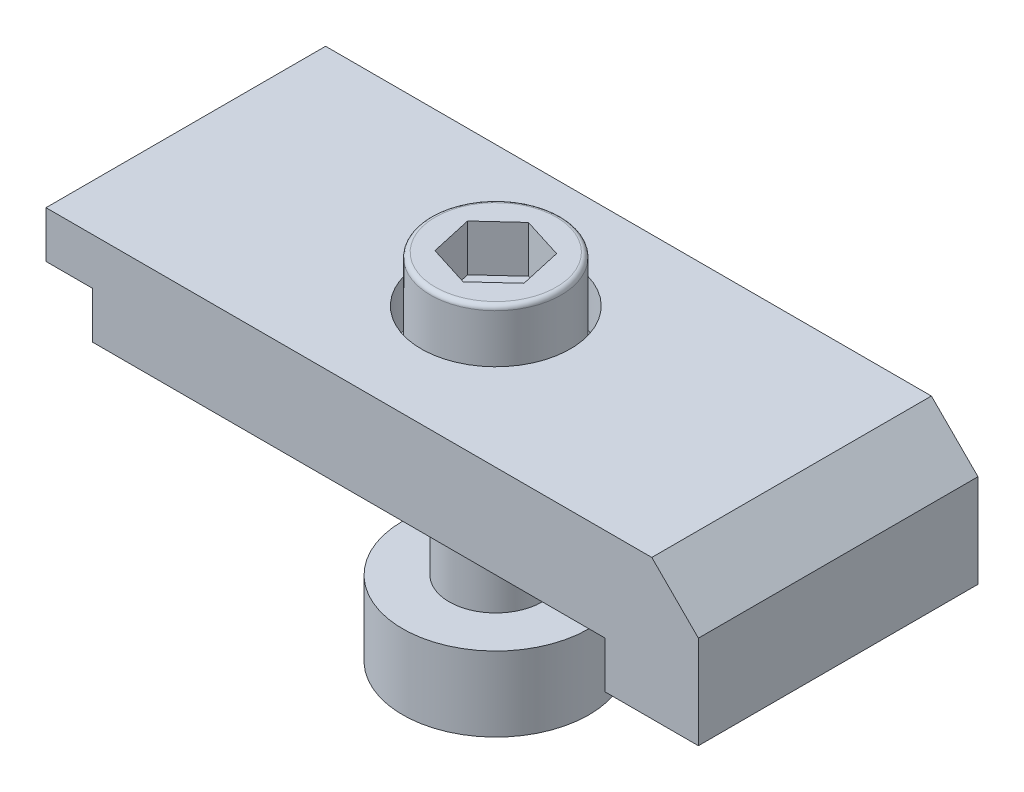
ISO-10303-21;
HEADER;
FILE_DESCRIPTION(('STEP AP214'),'2;1');
FILE_NAME('part.step','',(''),(''),'','','');
FILE_SCHEMA(('AUTOMOTIVE_DESIGN { 1 0 10303 214 1 1 1 1 }'));
ENDSEC;
DATA;
#1=APPLICATION_CONTEXT('core data for automotive mechanical design processes');
#2=APPLICATION_PROTOCOL_DEFINITION('international standard','automotive_design',2000,#1);
#3=PRODUCT_CONTEXT('',#1,'mechanical');
#4=PRODUCT('Part','Part','',(#3));
#5=PRODUCT_RELATED_PRODUCT_CATEGORY('part','',(#4));
#6=PRODUCT_DEFINITION_FORMATION('','',#4);
#7=PRODUCT_DEFINITION_CONTEXT('part definition',#1,'design');
#8=PRODUCT_DEFINITION('design','',#6,#7);
#9=PRODUCT_DEFINITION_SHAPE('','',#8);
#10=(LENGTH_UNIT() NAMED_UNIT(*) SI_UNIT(.MILLI.,.METRE.));
#11=(NAMED_UNIT(*) PLANE_ANGLE_UNIT() SI_UNIT($,.RADIAN.));
#12=(NAMED_UNIT(*) SI_UNIT($,.STERADIAN.) SOLID_ANGLE_UNIT());
#13=UNCERTAINTY_MEASURE_WITH_UNIT(LENGTH_MEASURE(1.E-05),#10,'distance_accuracy_value','');
#14=(GEOMETRIC_REPRESENTATION_CONTEXT(3) GLOBAL_UNCERTAINTY_ASSIGNED_CONTEXT((#13)) GLOBAL_UNIT_ASSIGNED_CONTEXT((#10,
#11,#12)) REPRESENTATION_CONTEXT('',''));
#15=CARTESIAN_POINT('',(0.,0.,0.));
#16=DIRECTION('',(0.,0.,1.));
#17=DIRECTION('',(1.,0.,0.));
#18=AXIS2_PLACEMENT_3D('',#15,#16,#17);
#19=CARTESIAN_POINT('',(-36.7394672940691,-18.,0.));
#20=DIRECTION('',(0.,1.,0.));
#21=DIRECTION('',(-1.,0.,0.));
#22=AXIS2_PLACEMENT_3D('',#19,#20,#21);
#23=CYLINDRICAL_SURFACE('',#22,5.);
#24=CARTESIAN_POINT('',(-36.7394672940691,4.99999999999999,0.));
#25=DIRECTION('',(0.,1.,0.));
#26=DIRECTION('',(-1.,0.,0.));
#27=AXIS2_PLACEMENT_3D('',#24,#25,#26);
#28=CIRCLE('',#27,5.);
#29=CARTESIAN_POINT('',(-41.7394672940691,4.99999999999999,0.));
#30=VERTEX_POINT('',#29);
#31=EDGE_CURVE('E235',#30,#30,#28,.T.);
#32=ORIENTED_EDGE('',*,*,#31,.F.);
#33=EDGE_LOOP('',(#32));
#34=FACE_BOUND('',#33,.T.);
#35=CARTESIAN_POINT('',(-36.7394672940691,-10.,0.));
#36=DIRECTION('',(0.,-1.,0.));
#37=DIRECTION('',(1.,0.,0.));
#38=AXIS2_PLACEMENT_3D('',#35,#36,#37);
#39=CIRCLE('',#38,5.);
#40=CARTESIAN_POINT('',(-31.7394672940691,-10.,0.));
#41=VERTEX_POINT('',#40);
#42=EDGE_CURVE('E31',#41,#41,#39,.F.);
#43=ORIENTED_EDGE('',*,*,#42,.T.);
#44=EDGE_LOOP('',(#43));
#45=FACE_BOUND('',#44,.T.);
#46=ADVANCED_FACE('F27',(#34,#45),#23,.T.);
#47=CARTESIAN_POINT('',(-36.7394672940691,9.99999999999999,0.));
#48=DIRECTION('',(0.,1.,0.));
#49=DIRECTION('',(-1.,0.,0.));
#50=AXIS2_PLACEMENT_3D('',#47,#48,#49);
#51=PLANE('',#50);
#52=CARTESIAN_POINT('',(-36.7394672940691,9.99999999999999,0.));
#53=DIRECTION('',(0.,1.,0.));
#54=DIRECTION('',(-1.,0.,0.));
#55=AXIS2_PLACEMENT_3D('',#52,#53,#54);
#56=CIRCLE('',#55,8.);
#57=CARTESIAN_POINT('',(-44.7394672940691,9.99999999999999,0.));
#58=VERTEX_POINT('',#57);
#59=EDGE_CURVE('E164',#58,#58,#56,.T.);
#60=ORIENTED_EDGE('',*,*,#59,.T.);
#61=EDGE_LOOP('',(#60));
#62=FACE_BOUND('',#61,.T.);
#63=CARTESIAN_POINT('',(-36.7394672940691,9.99999999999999,0.));
#64=DIRECTION('',(0.,1.,0.));
#65=DIRECTION('',(-1.,0.,0.));
#66=AXIS2_PLACEMENT_3D('',#63,#64,#65);
#67=CIRCLE('',#66,7.);
#68=CARTESIAN_POINT('',(-43.7394672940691,9.99999999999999,0.));
#69=VERTEX_POINT('',#68);
#70=EDGE_CURVE('E157',#69,#69,#67,.T.);
#71=ORIENTED_EDGE('',*,*,#70,.F.);
#72=EDGE_LOOP('',(#71));
#73=FACE_BOUND('',#72,.T.);
#74=ADVANCED_FACE('F303',(#62,#73),#51,.T.);
#75=CARTESIAN_POINT('',(0.,15.,15.));
#76=DIRECTION('',(-1.,0.,0.));
#77=DIRECTION('',(0.,0.,1.));
#78=AXIS2_PLACEMENT_3D('',#75,#76,#77);
#79=PLANE('',#78);
#80=DIRECTION('',(0.,1.,0.));
#81=VECTOR('',#80,1.);
#82=CARTESIAN_POINT('',(0.,15.,-15.));
#83=LINE('',#82,#81);
#84=CARTESIAN_POINT('',(0.,0.,-15.));
#85=VERTEX_POINT('',#84);
#86=CARTESIAN_POINT('',(0.,9.99999999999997,-15.));
#87=VERTEX_POINT('',#86);
#88=EDGE_CURVE('E167',#85,#87,#83,.T.);
#89=ORIENTED_EDGE('',*,*,#88,.T.);
#90=DIRECTION('',(0.,0.,1.));
#91=VECTOR('',#90,1.);
#92=CARTESIAN_POINT('',(0.,9.99999999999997,15.));
#93=LINE('',#92,#91);
#94=CARTESIAN_POINT('',(0.,9.99999999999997,15.));
#95=VERTEX_POINT('',#94);
#96=EDGE_CURVE('E227',#87,#95,#93,.T.);
#97=ORIENTED_EDGE('',*,*,#96,.T.);
#98=DIRECTION('',(0.,1.,0.));
#99=VECTOR('',#98,1.);
#100=CARTESIAN_POINT('',(0.,15.,15.));
#101=LINE('',#100,#99);
#102=CARTESIAN_POINT('',(0.,0.,15.));
#103=VERTEX_POINT('',#102);
#104=EDGE_CURVE('E184',#103,#95,#101,.T.);
#105=ORIENTED_EDGE('',*,*,#104,.F.);
#106=DIRECTION('',(0.,0.,-1.));
#107=VECTOR('',#106,1.);
#108=CARTESIAN_POINT('',(0.,0.,15.));
#109=LINE('',#108,#107);
#110=EDGE_CURVE('E201',#103,#85,#109,.T.);
#111=ORIENTED_EDGE('',*,*,#110,.T.);
#112=EDGE_LOOP('',(#89,#97,#105,#111));
#113=FACE_BOUND('',#112,.T.);
#114=ADVANCED_FACE('F29',(#113),#79,.F.);
#115=CARTESIAN_POINT('',(-70.,15.,15.));
#116=DIRECTION('',(0.,-1.,0.));
#117=DIRECTION('',(1.,0.,0.));
#118=AXIS2_PLACEMENT_3D('',#115,#116,#117);
#119=PLANE('',#118);
#120=CARTESIAN_POINT('',(-36.7394672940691,15.,0.));
#121=DIRECTION('',(0.,1.,0.));
#122=DIRECTION('',(-1.,0.,0.));
#123=AXIS2_PLACEMENT_3D('',#120,#121,#122);
#124=CIRCLE('',#123,8.);
#125=CARTESIAN_POINT('',(-44.7394672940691,15.,0.));
#126=VERTEX_POINT('',#125);
#127=EDGE_CURVE('E160',#126,#126,#124,.T.);
#128=ORIENTED_EDGE('',*,*,#127,.F.);
#129=EDGE_LOOP('',(#128));
#130=FACE_BOUND('',#129,.T.);
#131=DIRECTION('',(-1.,0.,0.));
#132=VECTOR('',#131,1.);
#133=CARTESIAN_POINT('',(-70.,15.,15.));
#134=LINE('',#133,#132);
#135=CARTESIAN_POINT('',(-5.00000000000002,15.,15.));
#136=VERTEX_POINT('',#135);
#137=CARTESIAN_POINT('',(-70.,15.,15.));
#138=VERTEX_POINT('',#137);
#139=EDGE_CURVE('E187',#136,#138,#134,.T.);
#140=ORIENTED_EDGE('',*,*,#139,.F.);
#141=DIRECTION('',(0.,0.,-1.));
#142=VECTOR('',#141,1.);
#143=CARTESIAN_POINT('',(-5.,15.,15.));
#144=LINE('',#143,#142);
#145=CARTESIAN_POINT('',(-5.00000000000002,15.,-15.));
#146=VERTEX_POINT('',#145);
#147=EDGE_CURVE('E222',#136,#146,#144,.T.);
#148=ORIENTED_EDGE('',*,*,#147,.T.);
#149=DIRECTION('',(-1.,0.,0.));
#150=VECTOR('',#149,1.);
#151=CARTESIAN_POINT('',(-70.,15.,-15.));
#152=LINE('',#151,#150);
#153=CARTESIAN_POINT('',(-70.,15.,-15.));
#154=VERTEX_POINT('',#153);
#155=EDGE_CURVE('E170',#146,#154,#152,.T.);
#156=ORIENTED_EDGE('',*,*,#155,.T.);
#157=DIRECTION('',(0.,0.,-1.));
#158=VECTOR('',#157,1.);
#159=CARTESIAN_POINT('',(-70.,15.,15.));
#160=LINE('',#159,#158);
#161=EDGE_CURVE('E219',#138,#154,#160,.T.);
#162=ORIENTED_EDGE('',*,*,#161,.F.);
#163=EDGE_LOOP('',(#140,#148,#156,#162));
#164=FACE_BOUND('',#163,.T.);
#165=ADVANCED_FACE('F374',(#130,#164),#119,.F.);
#166=CARTESIAN_POINT('',(-70.,10.,15.));
#167=DIRECTION('',(1.,0.,0.));
#168=DIRECTION('',(0.,0.,-1.));
#169=AXIS2_PLACEMENT_3D('',#166,#167,#168);
#170=PLANE('',#169);
#171=DIRECTION('',(0.,-1.,0.));
#172=VECTOR('',#171,1.);
#173=CARTESIAN_POINT('',(-70.,10.,-15.));
#174=LINE('',#173,#172);
#175=CARTESIAN_POINT('',(-70.,10.,-15.));
#176=VERTEX_POINT('',#175);
#177=EDGE_CURVE('E172',#154,#176,#174,.T.);
#178=ORIENTED_EDGE('',*,*,#177,.T.);
#179=DIRECTION('',(0.,0.,-1.));
#180=VECTOR('',#179,1.);
#181=CARTESIAN_POINT('',(-70.,10.,15.));
#182=LINE('',#181,#180);
#183=CARTESIAN_POINT('',(-70.,10.,15.));
#184=VERTEX_POINT('',#183);
#185=EDGE_CURVE('E216',#184,#176,#182,.T.);
#186=ORIENTED_EDGE('',*,*,#185,.F.);
#187=DIRECTION('',(0.,-1.,0.));
#188=VECTOR('',#187,1.);
#189=CARTESIAN_POINT('',(-70.,10.,15.));
#190=LINE('',#189,#188);
#191=EDGE_CURVE('E189',#138,#184,#190,.T.);
#192=ORIENTED_EDGE('',*,*,#191,.F.);
#193=ORIENTED_EDGE('',*,*,#161,.T.);
#194=EDGE_LOOP('',(#178,#186,#192,#193));
#195=FACE_BOUND('',#194,.T.);
#196=ADVANCED_FACE('F371',(#195),#170,.F.);
#197=CARTESIAN_POINT('',(-65.,10.,15.));
#198=DIRECTION('',(0.,1.,0.));
#199=DIRECTION('',(-1.,0.,0.));
#200=AXIS2_PLACEMENT_3D('',#197,#198,#199);
#201=PLANE('',#200);
#202=DIRECTION('',(1.,0.,0.));
#203=VECTOR('',#202,1.);
#204=CARTESIAN_POINT('',(-65.,10.,-15.));
#205=LINE('',#204,#203);
#206=CARTESIAN_POINT('',(-65.,10.,-15.));
#207=VERTEX_POINT('',#206);
#208=EDGE_CURVE('E174',#176,#207,#205,.T.);
#209=ORIENTED_EDGE('',*,*,#208,.T.);
#210=DIRECTION('',(0.,0.,-1.));
#211=VECTOR('',#210,1.);
#212=CARTESIAN_POINT('',(-65.,10.,15.));
#213=LINE('',#212,#211);
#214=CARTESIAN_POINT('',(-65.,10.,15.));
#215=VERTEX_POINT('',#214);
#216=EDGE_CURVE('E213',#215,#207,#213,.T.);
#217=ORIENTED_EDGE('',*,*,#216,.F.);
#218=DIRECTION('',(1.,0.,0.));
#219=VECTOR('',#218,1.);
#220=CARTESIAN_POINT('',(-65.,10.,15.));
#221=LINE('',#220,#219);
#222=EDGE_CURVE('E191',#184,#215,#221,.T.);
#223=ORIENTED_EDGE('',*,*,#222,.F.);
#224=ORIENTED_EDGE('',*,*,#185,.T.);
#225=EDGE_LOOP('',(#209,#217,#223,#224));
#226=FACE_BOUND('',#225,.T.);
#227=ADVANCED_FACE('F367',(#226),#201,.F.);
#228=CARTESIAN_POINT('',(-65.,4.99999999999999,15.));
#229=DIRECTION('',(1.,0.,0.));
#230=DIRECTION('',(0.,0.,-1.));
#231=AXIS2_PLACEMENT_3D('',#228,#229,#230);
#232=PLANE('',#231);
#233=DIRECTION('',(0.,-1.,0.));
#234=VECTOR('',#233,1.);
#235=CARTESIAN_POINT('',(-65.,4.99999999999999,-15.));
#236=LINE('',#235,#234);
#237=CARTESIAN_POINT('',(-65.,4.99999999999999,-15.));
#238=VERTEX_POINT('',#237);
#239=EDGE_CURVE('E176',#207,#238,#236,.T.);
#240=ORIENTED_EDGE('',*,*,#239,.T.);
#241=DIRECTION('',(0.,0.,-1.));
#242=VECTOR('',#241,1.);
#243=CARTESIAN_POINT('',(-65.,4.99999999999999,15.));
#244=LINE('',#243,#242);
#245=CARTESIAN_POINT('',(-65.,4.99999999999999,15.));
#246=VERTEX_POINT('',#245);
#247=EDGE_CURVE('E210',#246,#238,#244,.T.);
#248=ORIENTED_EDGE('',*,*,#247,.F.);
#249=DIRECTION('',(0.,-1.,0.));
#250=VECTOR('',#249,1.);
#251=CARTESIAN_POINT('',(-65.,4.99999999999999,15.));
#252=LINE('',#251,#250);
#253=EDGE_CURVE('E193',#215,#246,#252,.T.);
#254=ORIENTED_EDGE('',*,*,#253,.F.);
#255=ORIENTED_EDGE('',*,*,#216,.T.);
#256=EDGE_LOOP('',(#240,#248,#254,#255));
#257=FACE_BOUND('',#256,.T.);
#258=ADVANCED_FACE('F364',(#257),#232,.F.);
#259=CARTESIAN_POINT('',(-10.,5.,15.));
#260=DIRECTION('',(0.,1.,0.));
#261=DIRECTION('',(-1.,0.,0.));
#262=AXIS2_PLACEMENT_3D('',#259,#260,#261);
#263=PLANE('',#262);
#264=ORIENTED_EDGE('',*,*,#31,.T.);
#265=EDGE_LOOP('',(#264));
#266=FACE_BOUND('',#265,.T.);
#267=DIRECTION('',(1.,0.,0.));
#268=VECTOR('',#267,1.);
#269=CARTESIAN_POINT('',(-10.,5.,-15.));
#270=LINE('',#269,#268);
#271=CARTESIAN_POINT('',(-10.,5.,-15.));
#272=VERTEX_POINT('',#271);
#273=EDGE_CURVE('E178',#238,#272,#270,.T.);
#274=ORIENTED_EDGE('',*,*,#273,.T.);
#275=DIRECTION('',(0.,0.,-1.));
#276=VECTOR('',#275,1.);
#277=CARTESIAN_POINT('',(-10.,5.,15.));
#278=LINE('',#277,#276);
#279=CARTESIAN_POINT('',(-10.,5.,15.));
#280=VERTEX_POINT('',#279);
#281=EDGE_CURVE('E207',#280,#272,#278,.T.);
#282=ORIENTED_EDGE('',*,*,#281,.F.);
#283=DIRECTION('',(1.,0.,0.));
#284=VECTOR('',#283,1.);
#285=CARTESIAN_POINT('',(-10.,5.,15.));
#286=LINE('',#285,#284);
#287=EDGE_CURVE('E195',#246,#280,#286,.T.);
#288=ORIENTED_EDGE('',*,*,#287,.F.);
#289=ORIENTED_EDGE('',*,*,#247,.T.);
#290=EDGE_LOOP('',(#274,#282,#288,#289));
#291=FACE_BOUND('',#290,.T.);
#292=ADVANCED_FACE('F360',(#266,#291),#263,.F.);
#293=CARTESIAN_POINT('',(-10.,0.,15.));
#294=DIRECTION('',(1.,0.,0.));
#295=DIRECTION('',(0.,0.,-1.));
#296=AXIS2_PLACEMENT_3D('',#293,#294,#295);
#297=PLANE('',#296);
#298=DIRECTION('',(0.,-1.,0.));
#299=VECTOR('',#298,1.);
#300=CARTESIAN_POINT('',(-10.,0.,-15.));
#301=LINE('',#300,#299);
#302=CARTESIAN_POINT('',(-10.,0.,-15.));
#303=VERTEX_POINT('',#302);
#304=EDGE_CURVE('E180',#272,#303,#301,.T.);
#305=ORIENTED_EDGE('',*,*,#304,.T.);
#306=DIRECTION('',(0.,0.,-1.));
#307=VECTOR('',#306,1.);
#308=CARTESIAN_POINT('',(-10.,0.,15.));
#309=LINE('',#308,#307);
#310=CARTESIAN_POINT('',(-10.,0.,15.));
#311=VERTEX_POINT('',#310);
#312=EDGE_CURVE('E204',#311,#303,#309,.T.);
#313=ORIENTED_EDGE('',*,*,#312,.F.);
#314=DIRECTION('',(0.,-1.,0.));
#315=VECTOR('',#314,1.);
#316=CARTESIAN_POINT('',(-10.,0.,15.));
#317=LINE('',#316,#315);
#318=EDGE_CURVE('E197',#280,#311,#317,.T.);
#319=ORIENTED_EDGE('',*,*,#318,.F.);
#320=ORIENTED_EDGE('',*,*,#281,.T.);
#321=EDGE_LOOP('',(#305,#313,#319,#320));
#322=FACE_BOUND('',#321,.T.);
#323=ADVANCED_FACE('F356',(#322),#297,.F.);
#324=CARTESIAN_POINT('',(0.,0.,15.));
#325=DIRECTION('',(0.,1.,0.));
#326=DIRECTION('',(-1.,0.,0.));
#327=AXIS2_PLACEMENT_3D('',#324,#325,#326);
#328=PLANE('',#327);
#329=DIRECTION('',(1.,0.,0.));
#330=VECTOR('',#329,1.);
#331=CARTESIAN_POINT('',(0.,0.,-15.));
#332=LINE('',#331,#330);
#333=EDGE_CURVE('E182',#303,#85,#332,.T.);
#334=ORIENTED_EDGE('',*,*,#333,.T.);
#335=ORIENTED_EDGE('',*,*,#110,.F.);
#336=DIRECTION('',(1.,0.,0.));
#337=VECTOR('',#336,1.);
#338=CARTESIAN_POINT('',(0.,0.,15.));
#339=LINE('',#338,#337);
#340=EDGE_CURVE('E199',#311,#103,#339,.T.);
#341=ORIENTED_EDGE('',*,*,#340,.F.);
#342=ORIENTED_EDGE('',*,*,#312,.T.);
#343=EDGE_LOOP('',(#334,#335,#341,#342));
#344=FACE_BOUND('',#343,.T.);
#345=ADVANCED_FACE('F352',(#344),#328,.F.);
#346=CARTESIAN_POINT('',(0.,15.,15.));
#347=DIRECTION('',(0.,0.,1.));
#348=DIRECTION('',(1.,0.,0.));
#349=AXIS2_PLACEMENT_3D('',#346,#347,#348);
#350=PLANE('',#349);
#351=ORIENTED_EDGE('',*,*,#104,.T.);
#352=DIRECTION('',(0.707106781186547,-0.707106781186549,0.));
#353=VECTOR('',#352,1.);
#354=CARTESIAN_POINT('',(-2.50000000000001,12.5,15.));
#355=LINE('',#354,#353);
#356=EDGE_CURVE('E229',#95,#136,#355,.F.);
#357=ORIENTED_EDGE('',*,*,#356,.T.);
#358=ORIENTED_EDGE('',*,*,#139,.T.);
#359=ORIENTED_EDGE('',*,*,#191,.T.);
#360=ORIENTED_EDGE('',*,*,#222,.T.);
#361=ORIENTED_EDGE('',*,*,#253,.T.);
#362=ORIENTED_EDGE('',*,*,#287,.T.);
#363=ORIENTED_EDGE('',*,*,#318,.T.);
#364=ORIENTED_EDGE('',*,*,#340,.T.);
#365=EDGE_LOOP('',(#351,#357,#358,#359,#360,#361,#362,#363,#364));
#366=FACE_BOUND('',#365,.T.);
#367=ADVANCED_FACE('F348',(#366),#350,.T.);
#368=CARTESIAN_POINT('',(0.,15.,-15.));
#369=DIRECTION('',(0.,0.,1.));
#370=DIRECTION('',(1.,0.,0.));
#371=AXIS2_PLACEMENT_3D('',#368,#369,#370);
#372=PLANE('',#371);
#373=ORIENTED_EDGE('',*,*,#155,.F.);
#374=DIRECTION('',(-0.707106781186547,0.707106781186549,0.));
#375=VECTOR('',#374,1.);
#376=CARTESIAN_POINT('',(-5.,15.,-15.));
#377=LINE('',#376,#375);
#378=EDGE_CURVE('E225',#146,#87,#377,.F.);
#379=ORIENTED_EDGE('',*,*,#378,.T.);
#380=ORIENTED_EDGE('',*,*,#88,.F.);
#381=ORIENTED_EDGE('',*,*,#333,.F.);
#382=ORIENTED_EDGE('',*,*,#304,.F.);
#383=ORIENTED_EDGE('',*,*,#273,.F.);
#384=ORIENTED_EDGE('',*,*,#239,.F.);
#385=ORIENTED_EDGE('',*,*,#208,.F.);
#386=ORIENTED_EDGE('',*,*,#177,.F.);
#387=EDGE_LOOP('',(#373,#379,#380,#381,#382,#383,#384,#385,#386));
#388=FACE_BOUND('',#387,.T.);
#389=ADVANCED_FACE('F344',(#388),#372,.F.);
#390=CARTESIAN_POINT('',(-5.,15.,15.));
#391=DIRECTION('',(-0.707106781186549,-0.707106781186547,0.));
#392=DIRECTION('',(0.707106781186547,-0.707106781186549,0.));
#393=AXIS2_PLACEMENT_3D('',#390,#391,#392);
#394=PLANE('',#393);
#395=ORIENTED_EDGE('',*,*,#356,.F.);
#396=ORIENTED_EDGE('',*,*,#96,.F.);
#397=ORIENTED_EDGE('',*,*,#378,.F.);
#398=ORIENTED_EDGE('',*,*,#147,.F.);
#399=EDGE_LOOP('',(#395,#396,#397,#398));
#400=FACE_BOUND('',#399,.T.);
#401=ADVANCED_FACE('F340',(#400),#394,.F.);
#402=CARTESIAN_POINT('',(-36.7394672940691,9.99999999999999,0.));
#403=DIRECTION('',(0.,1.,0.));
#404=DIRECTION('',(-1.,0.,0.));
#405=AXIS2_PLACEMENT_3D('',#402,#403,#404);
#406=CYLINDRICAL_SURFACE('',#405,8.);
#407=ORIENTED_EDGE('',*,*,#59,.F.);
#408=EDGE_LOOP('',(#407));
#409=FACE_BOUND('',#408,.T.);
#410=ORIENTED_EDGE('',*,*,#127,.T.);
#411=EDGE_LOOP('',(#410));
#412=FACE_BOUND('',#411,.T.);
#413=ADVANCED_FACE('F335',(#409,#412),#406,.F.);
#414=CARTESIAN_POINT('',(-36.7394672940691,20.,0.));
#415=DIRECTION('',(0.,-1.,0.));
#416=DIRECTION('',(1.,0.,0.));
#417=AXIS2_PLACEMENT_3D('',#414,#415,#416);
#418=CYLINDRICAL_SURFACE('',#417,7.);
#419=CARTESIAN_POINT('',(-36.7394672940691,19.5,0.));
#420=DIRECTION('',(0.,1.,0.));
#421=DIRECTION('',(-1.,0.,0.));
#422=AXIS2_PLACEMENT_3D('',#419,#420,#421);
#423=CIRCLE('',#422,7.);
#424=CARTESIAN_POINT('',(-43.7394672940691,19.5,0.));
#425=VERTEX_POINT('',#424);
#426=EDGE_CURVE('E36',#425,#425,#423,.F.);
#427=ORIENTED_EDGE('',*,*,#426,.T.);
#428=EDGE_LOOP('',(#427));
#429=FACE_BOUND('',#428,.T.);
#430=ORIENTED_EDGE('',*,*,#70,.T.);
#431=EDGE_LOOP('',(#430));
#432=FACE_BOUND('',#431,.T.);
#433=ADVANCED_FACE('F332',(#429,#432),#418,.T.);
#434=CARTESIAN_POINT('',(-36.7394672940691,20.,0.));
#435=DIRECTION('',(0.,1.,0.));
#436=DIRECTION('',(-1.,0.,0.));
#437=AXIS2_PLACEMENT_3D('',#434,#435,#436);
#438=PLANE('',#437);
#439=CARTESIAN_POINT('',(-36.7394672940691,20.,0.));
#440=DIRECTION('',(0.,1.,0.));
#441=DIRECTION('',(-1.,0.,0.));
#442=AXIS2_PLACEMENT_3D('',#439,#440,#441);
#443=CIRCLE('',#442,6.5);
#444=CARTESIAN_POINT('',(-43.2394672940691,20.,0.));
#445=VERTEX_POINT('',#444);
#446=EDGE_CURVE('E231',#445,#445,#443,.T.);
#447=ORIENTED_EDGE('',*,*,#446,.T.);
#448=EDGE_LOOP('',(#447));
#449=FACE_BOUND('',#448,.T.);
#450=DIRECTION('',(-0.218038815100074,0.,-0.975940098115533));
#451=VECTOR('',#450,1.);
#452=CARTESIAN_POINT('',(-32.3321678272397,20.,1.38168185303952));
#453=LINE('',#452,#451);
#454=CARTESIAN_POINT('',(-32.3321678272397,20.,1.38168185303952));
#455=VERTEX_POINT('',#454);
#456=CARTESIAN_POINT('',(-33.3392459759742,20.,-3.1259923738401));
#457=VERTEX_POINT('',#456);
#458=EDGE_CURVE('E237',#455,#457,#453,.T.);
#459=ORIENTED_EDGE('',*,*,#458,.F.);
#460=DIRECTION('',(0.736169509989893,0.,-0.676797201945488));
#461=VECTOR('',#460,1.);
#462=CARTESIAN_POINT('',(-35.7323891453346,20.,4.50767422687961));
#463=LINE('',#462,#461);
#464=CARTESIAN_POINT('',(-35.7323891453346,20.,4.50767422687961));
#465=VERTEX_POINT('',#464);
#466=EDGE_CURVE('E153',#465,#455,#463,.T.);
#467=ORIENTED_EDGE('',*,*,#466,.F.);
#468=DIRECTION('',(0.954208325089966,0.,0.299142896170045));
#469=VECTOR('',#468,1.);
#470=CARTESIAN_POINT('',(-40.139688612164,20.,3.12599237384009));
#471=LINE('',#470,#469);
#472=CARTESIAN_POINT('',(-40.139688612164,20.,3.12599237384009));
#473=VERTEX_POINT('',#472);
#474=EDGE_CURVE('E256',#473,#465,#471,.T.);
#475=ORIENTED_EDGE('',*,*,#474,.F.);
#476=DIRECTION('',(0.218038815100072,0.,0.975940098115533));
#477=VECTOR('',#476,1.);
#478=CARTESIAN_POINT('',(-41.1467667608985,20.,-1.38168185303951));
#479=LINE('',#478,#477);
#480=CARTESIAN_POINT('',(-41.1467667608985,20.,-1.38168185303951));
#481=VERTEX_POINT('',#480);
#482=EDGE_CURVE('E253',#481,#473,#479,.T.);
#483=ORIENTED_EDGE('',*,*,#482,.F.);
#484=DIRECTION('',(-0.736169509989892,0.,0.676797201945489));
#485=VECTOR('',#484,1.);
#486=CARTESIAN_POINT('',(-37.7465454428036,20.,-4.50767422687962));
#487=LINE('',#486,#485);
#488=CARTESIAN_POINT('',(-37.7465454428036,20.,-4.50767422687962));
#489=VERTEX_POINT('',#488);
#490=EDGE_CURVE('E251',#489,#481,#487,.T.);
#491=ORIENTED_EDGE('',*,*,#490,.F.);
#492=DIRECTION('',(-0.954208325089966,0.,-0.299142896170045));
#493=VECTOR('',#492,1.);
#494=CARTESIAN_POINT('',(-33.3392459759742,20.,-3.1259923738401));
#495=LINE('',#494,#493);
#496=EDGE_CURVE('E148',#457,#489,#495,.T.);
#497=ORIENTED_EDGE('',*,*,#496,.F.);
#498=EDGE_LOOP('',(#459,#467,#475,#483,#491,#497));
#499=FACE_BOUND('',#498,.T.);
#500=ADVANCED_FACE('F275',(#449,#499),#438,.T.);
#501=CARTESIAN_POINT('',(-32.3321678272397,14.,1.38168185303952));
#502=DIRECTION('',(0.975940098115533,0.,-0.218038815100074));
#503=DIRECTION('',(-0.218038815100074,0.,-0.975940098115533));
#504=AXIS2_PLACEMENT_3D('',#501,#502,#503);
#505=PLANE('',#504);
#506=DIRECTION('',(0.,1.,0.));
#507=VECTOR('',#506,1.);
#508=CARTESIAN_POINT('',(-33.3392459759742,14.,-3.1259923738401));
#509=LINE('',#508,#507);
#510=CARTESIAN_POINT('',(-33.3392459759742,15.,-3.1259923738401));
#511=VERTEX_POINT('',#510);
#512=EDGE_CURVE('E50',#511,#457,#509,.T.);
#513=ORIENTED_EDGE('',*,*,#512,.F.);
#514=DIRECTION('',(0.218038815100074,0.,0.975940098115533));
#515=VECTOR('',#514,1.);
#516=CARTESIAN_POINT('',(-32.3321678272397,15.,1.38168185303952));
#517=LINE('',#516,#515);
#518=CARTESIAN_POINT('',(-32.3321678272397,15.,1.38168185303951));
#519=VERTEX_POINT('',#518);
#520=EDGE_CURVE('E44',#511,#519,#517,.T.);
#521=ORIENTED_EDGE('',*,*,#520,.T.);
#522=DIRECTION('',(0.,1.,0.));
#523=VECTOR('',#522,1.);
#524=CARTESIAN_POINT('',(-32.3321678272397,14.,1.38168185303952));
#525=LINE('',#524,#523);
#526=EDGE_CURVE('E161',#519,#455,#525,.T.);
#527=ORIENTED_EDGE('',*,*,#526,.T.);
#528=ORIENTED_EDGE('',*,*,#458,.T.);
#529=EDGE_LOOP('',(#513,#521,#527,#528));
#530=FACE_BOUND('',#529,.T.);
#531=ADVANCED_FACE('F319',(#530),#505,.F.);
#532=CARTESIAN_POINT('',(-35.7323891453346,14.,4.50767422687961));
#533=DIRECTION('',(0.676797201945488,0.,0.736169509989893));
#534=DIRECTION('',(0.736169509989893,0.,-0.676797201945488));
#535=AXIS2_PLACEMENT_3D('',#532,#533,#534);
#536=PLANE('',#535);
#537=ORIENTED_EDGE('',*,*,#526,.F.);
#538=DIRECTION('',(-0.736169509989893,0.,0.676797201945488));
#539=VECTOR('',#538,1.);
#540=CARTESIAN_POINT('',(-35.7323891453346,15.,4.50767422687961));
#541=LINE('',#540,#539);
#542=CARTESIAN_POINT('',(-35.7323891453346,15.,4.50767422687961));
#543=VERTEX_POINT('',#542);
#544=EDGE_CURVE('E241',#519,#543,#541,.T.);
#545=ORIENTED_EDGE('',*,*,#544,.T.);
#546=DIRECTION('',(0.,1.,0.));
#547=VECTOR('',#546,1.);
#548=CARTESIAN_POINT('',(-35.7323891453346,14.,4.50767422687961));
#549=LINE('',#548,#547);
#550=EDGE_CURVE('E262',#543,#465,#549,.T.);
#551=ORIENTED_EDGE('',*,*,#550,.T.);
#552=ORIENTED_EDGE('',*,*,#466,.T.);
#553=EDGE_LOOP('',(#537,#545,#551,#552));
#554=FACE_BOUND('',#553,.T.);
#555=ADVANCED_FACE('F277',(#554),#536,.F.);
#556=CARTESIAN_POINT('',(-40.139688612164,14.,3.12599237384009));
#557=DIRECTION('',(-0.299142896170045,0.,0.954208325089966));
#558=DIRECTION('',(0.954208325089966,0.,0.299142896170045));
#559=AXIS2_PLACEMENT_3D('',#556,#557,#558);
#560=PLANE('',#559);
#561=ORIENTED_EDGE('',*,*,#550,.F.);
#562=DIRECTION('',(-0.954208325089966,0.,-0.299142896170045));
#563=VECTOR('',#562,1.);
#564=CARTESIAN_POINT('',(-40.139688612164,15.,3.12599237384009));
#565=LINE('',#564,#563);
#566=CARTESIAN_POINT('',(-40.139688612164,15.,3.12599237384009));
#567=VERTEX_POINT('',#566);
#568=EDGE_CURVE('E246',#543,#567,#565,.T.);
#569=ORIENTED_EDGE('',*,*,#568,.T.);
#570=DIRECTION('',(0.,1.,0.));
#571=VECTOR('',#570,1.);
#572=CARTESIAN_POINT('',(-40.139688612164,14.,3.12599237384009));
#573=LINE('',#572,#571);
#574=EDGE_CURVE('E151',#567,#473,#573,.T.);
#575=ORIENTED_EDGE('',*,*,#574,.T.);
#576=ORIENTED_EDGE('',*,*,#474,.T.);
#577=EDGE_LOOP('',(#561,#569,#575,#576));
#578=FACE_BOUND('',#577,.T.);
#579=ADVANCED_FACE('F267',(#578),#560,.F.);
#580=CARTESIAN_POINT('',(-41.1467667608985,14.,-1.38168185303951));
#581=DIRECTION('',(-0.975940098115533,0.,0.218038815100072));
#582=DIRECTION('',(0.218038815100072,0.,0.975940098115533));
#583=AXIS2_PLACEMENT_3D('',#580,#581,#582);
#584=PLANE('',#583);
#585=ORIENTED_EDGE('',*,*,#574,.F.);
#586=DIRECTION('',(-0.218038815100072,0.,-0.975940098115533));
#587=VECTOR('',#586,1.);
#588=CARTESIAN_POINT('',(-41.1467667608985,15.,-1.38168185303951));
#589=LINE('',#588,#587);
#590=CARTESIAN_POINT('',(-41.1467667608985,15.,-1.38168185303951));
#591=VERTEX_POINT('',#590);
#592=EDGE_CURVE('E144',#567,#591,#589,.T.);
#593=ORIENTED_EDGE('',*,*,#592,.T.);
#594=DIRECTION('',(0.,1.,0.));
#595=VECTOR('',#594,1.);
#596=CARTESIAN_POINT('',(-41.1467667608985,14.,-1.38168185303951));
#597=LINE('',#596,#595);
#598=EDGE_CURVE('E143',#591,#481,#597,.T.);
#599=ORIENTED_EDGE('',*,*,#598,.T.);
#600=ORIENTED_EDGE('',*,*,#482,.T.);
#601=EDGE_LOOP('',(#585,#593,#599,#600));
#602=FACE_BOUND('',#601,.T.);
#603=ADVANCED_FACE('F272',(#602),#584,.F.);
#604=CARTESIAN_POINT('',(-37.7465454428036,14.,-4.50767422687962));
#605=DIRECTION('',(-0.676797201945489,0.,-0.736169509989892));
#606=DIRECTION('',(-0.736169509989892,0.,0.676797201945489));
#607=AXIS2_PLACEMENT_3D('',#604,#605,#606);
#608=PLANE('',#607);
#609=ORIENTED_EDGE('',*,*,#598,.F.);
#610=DIRECTION('',(0.736169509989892,0.,-0.676797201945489));
#611=VECTOR('',#610,1.);
#612=CARTESIAN_POINT('',(-37.7465454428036,15.,-4.50767422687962));
#613=LINE('',#612,#611);
#614=CARTESIAN_POINT('',(-37.7465454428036,15.,-4.50767422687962));
#615=VERTEX_POINT('',#614);
#616=EDGE_CURVE('E135',#591,#615,#613,.T.);
#617=ORIENTED_EDGE('',*,*,#616,.T.);
#618=DIRECTION('',(0.,1.,0.));
#619=VECTOR('',#618,1.);
#620=CARTESIAN_POINT('',(-37.7465454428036,14.,-4.50767422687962));
#621=LINE('',#620,#619);
#622=EDGE_CURVE('E142',#615,#489,#621,.T.);
#623=ORIENTED_EDGE('',*,*,#622,.T.);
#624=ORIENTED_EDGE('',*,*,#490,.T.);
#625=EDGE_LOOP('',(#609,#617,#623,#624));
#626=FACE_BOUND('',#625,.T.);
#627=ADVANCED_FACE('F140',(#626),#608,.F.);
#628=CARTESIAN_POINT('',(-33.3392459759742,14.,-3.1259923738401));
#629=DIRECTION('',(0.299142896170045,0.,-0.954208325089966));
#630=DIRECTION('',(-0.954208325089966,0.,-0.299142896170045));
#631=AXIS2_PLACEMENT_3D('',#628,#629,#630);
#632=PLANE('',#631);
#633=ORIENTED_EDGE('',*,*,#622,.F.);
#634=DIRECTION('',(0.954208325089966,0.,0.299142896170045));
#635=VECTOR('',#634,1.);
#636=CARTESIAN_POINT('',(-33.3392459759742,15.,-3.1259923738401));
#637=LINE('',#636,#635);
#638=EDGE_CURVE('E11',#615,#511,#637,.T.);
#639=ORIENTED_EDGE('',*,*,#638,.T.);
#640=ORIENTED_EDGE('',*,*,#512,.T.);
#641=ORIENTED_EDGE('',*,*,#496,.T.);
#642=EDGE_LOOP('',(#633,#639,#640,#641));
#643=FACE_BOUND('',#642,.T.);
#644=ADVANCED_FACE('F146',(#643),#632,.F.);
#645=CARTESIAN_POINT('',(-36.7394672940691,19.5,0.));
#646=DIRECTION('',(0.,1.,0.));
#647=DIRECTION('',(-1.,0.,0.));
#648=AXIS2_PLACEMENT_3D('',#645,#646,#647);
#649=TOROIDAL_SURFACE('',#648,6.5,0.5);
#650=ORIENTED_EDGE('',*,*,#426,.F.);
#651=EDGE_LOOP('',(#650));
#652=FACE_BOUND('',#651,.T.);
#653=ORIENTED_EDGE('',*,*,#446,.F.);
#654=EDGE_LOOP('',(#653));
#655=FACE_BOUND('',#654,.T.);
#656=ADVANCED_FACE('F301',(#652,#655),#649,.T.);
#657=CARTESIAN_POINT('',(-36.7394672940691,15.,0.));
#658=DIRECTION('',(0.,1.,0.));
#659=DIRECTION('',(-1.,0.,0.));
#660=AXIS2_PLACEMENT_3D('',#657,#658,#659);
#661=PLANE('',#660);
#662=ORIENTED_EDGE('',*,*,#520,.F.);
#663=ORIENTED_EDGE('',*,*,#638,.F.);
#664=ORIENTED_EDGE('',*,*,#616,.F.);
#665=ORIENTED_EDGE('',*,*,#592,.F.);
#666=ORIENTED_EDGE('',*,*,#568,.F.);
#667=ORIENTED_EDGE('',*,*,#544,.F.);
#668=EDGE_LOOP('',(#662,#663,#664,#665,#666,#667));
#669=FACE_BOUND('',#668,.T.);
#670=ADVANCED_FACE('F134',(#669),#661,.T.);
#671=CARTESIAN_POINT('',(-36.7394672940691,-10.,0.));
#672=DIRECTION('',(0.,-1.,0.));
#673=DIRECTION('',(1.,0.,0.));
#674=AXIS2_PLACEMENT_3D('',#671,#672,#673);
#675=CYLINDRICAL_SURFACE('',#674,10.);
#676=CARTESIAN_POINT('',(-36.7394672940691,-10.,0.));
#677=DIRECTION('',(0.,-1.,0.));
#678=DIRECTION('',(1.,0.,0.));
#679=AXIS2_PLACEMENT_3D('',#676,#677,#678);
#680=CIRCLE('',#679,10.);
#681=CARTESIAN_POINT('',(-26.7394672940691,-10.,0.));
#682=VERTEX_POINT('',#681);
#683=EDGE_CURVE('E280',#682,#682,#680,.T.);
#684=ORIENTED_EDGE('',*,*,#683,.T.);
#685=EDGE_LOOP('',(#684));
#686=FACE_BOUND('',#685,.T.);
#687=CARTESIAN_POINT('',(-36.7394672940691,-18.,0.));
#688=DIRECTION('',(0.,-1.,0.));
#689=DIRECTION('',(1.,0.,0.));
#690=AXIS2_PLACEMENT_3D('',#687,#688,#689);
#691=CIRCLE('',#690,10.);
#692=CARTESIAN_POINT('',(-26.7394672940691,-18.,0.));
#693=VERTEX_POINT('',#692);
#694=EDGE_CURVE('E283',#693,#693,#691,.T.);
#695=ORIENTED_EDGE('',*,*,#694,.F.);
#696=EDGE_LOOP('',(#695));
#697=FACE_BOUND('',#696,.T.);
#698=ADVANCED_FACE('F289',(#686,#697),#675,.T.);
#699=CARTESIAN_POINT('',(-36.7394672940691,-10.,0.));
#700=DIRECTION('',(0.,-1.,0.));
#701=DIRECTION('',(1.,0.,0.));
#702=AXIS2_PLACEMENT_3D('',#699,#700,#701);
#703=PLANE('',#702);
#704=ORIENTED_EDGE('',*,*,#42,.F.);
#705=EDGE_LOOP('',(#704));
#706=FACE_BOUND('',#705,.T.);
#707=ORIENTED_EDGE('',*,*,#683,.F.);
#708=EDGE_LOOP('',(#707));
#709=FACE_BOUND('',#708,.T.);
#710=ADVANCED_FACE('F291',(#706,#709),#703,.F.);
#711=CARTESIAN_POINT('',(-36.7394672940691,-18.,0.));
#712=DIRECTION('',(0.,1.,0.));
#713=DIRECTION('',(-1.,0.,0.));
#714=AXIS2_PLACEMENT_3D('',#711,#712,#713);
#715=PLANE('',#714);
#716=ORIENTED_EDGE('',*,*,#694,.T.);
#717=EDGE_LOOP('',(#716));
#718=FACE_BOUND('',#717,.T.);
#719=ADVANCED_FACE('F287',(#718),#715,.F.);
#720=CLOSED_SHELL('',(#46,#74,#114,#165,#196,#227,#258,#292,#323,#345,#367,#389,#401,#413,#433,
#500,#531,#555,#579,#603,#627,#644,#656,#670,#698,#710,#719));
#721=MANIFOLD_SOLID_BREP('B2',#720);
#722=ADVANCED_BREP_SHAPE_REPRESENTATION('',(#18,#721),#14);
#723=SHAPE_DEFINITION_REPRESENTATION(#9,#722);
ENDSEC;
END-ISO-10303-21;
